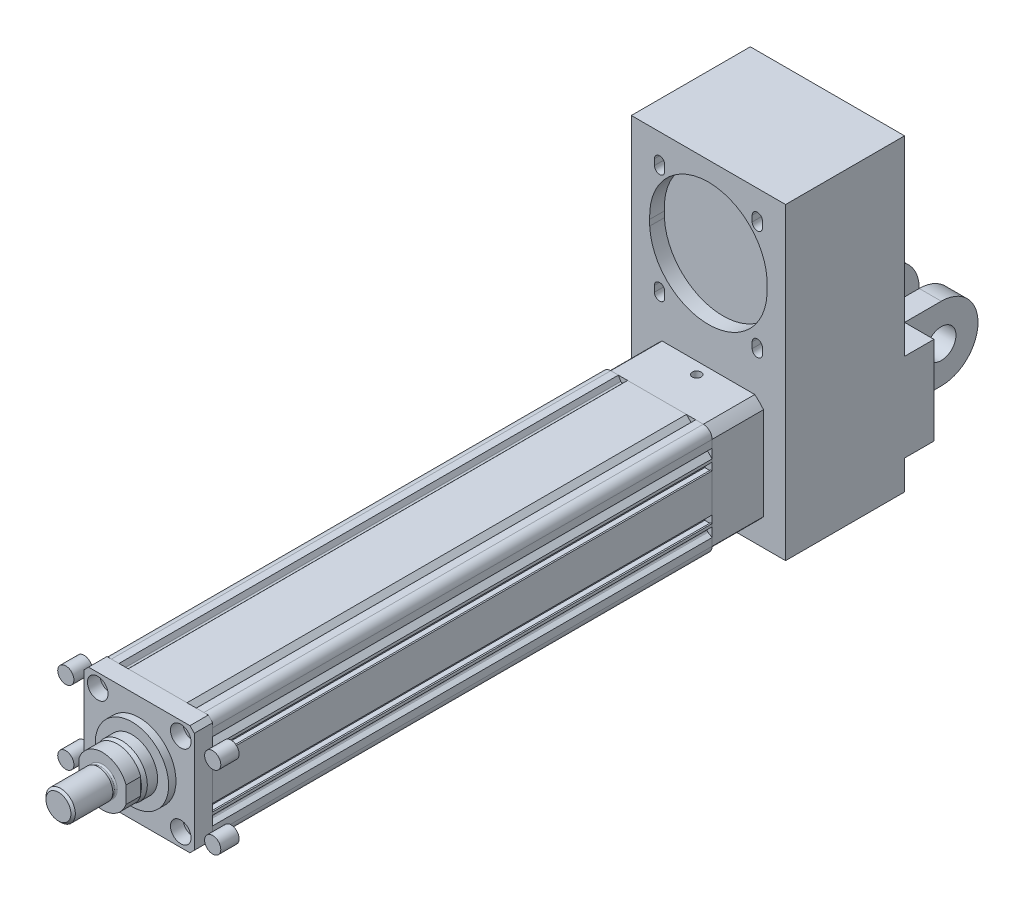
from build123d import *

# Parameters (mm, degrees)
SKETCH_1_R           = 31.5
SKETCH_1_R_2         = 3.35
EXTRUDE_1_DEPTH      = 340
SKETCH_2_R           = 5.5
EXTRUDE_1_2_DEPTH    = 12.5
EXTRUDE_1_2_2_DEPTH  = 12.5
EXTRUDE_1_2_3_DEPTH  = 12.5
EXTRUDE_1_2_4_DEPTH  = 12.5
SKETCH_2_R_2         = 4.25
EXTRUDE_1_2_5_DEPTH  = 12.5
SKETCH_3_R           = 7
SKETCH_3_R_2         = 4.25
CUT_EXTRUDE_1_DEPTH  = 8.5
SKETCH_3_3_R         = 25
EXTRUDE_2_DEPTH      = 5
SKETCH_5_R           = 17.5
EXTRUDE_3_DEPTH      = 10
CHAMFER_1_SIZE       = 3
CHAMFER_1_SIZE2      = 1
EXTRUDE_4_DEPTH      = 10
SKETCH_8_R           = 9
EXTRUDE_5_DEPTH      = 3
SKETCH_9_R           = 10
EXTRUDE_6_DEPTH      = 27
CHAMFER_2_SIZE       = 1.5
FILLET_1_R           = 1
EXTRUDE_7_DEPTH      = 35
SKETCH_11_R          = 3
CUT_EXTRUDE_2_DEPTH  = 5
SKETCH_18_W          = 105
SKETCH_18_H          = 210
EXTRUDE_11_DEPTH     = 81
CUT_EXTRUDE_7_DEPTH  = 10
CUT_EXTRUDE_START    = -10
CUT_EXTRUDE_9_DEPTH  = 5
SKETCH_23_W          = 105
SKETCH_23_H          = 60
EXTRUDE_12_DEPTH     = 20
SKETCH_23_3_W        = 15
SKETCH_23_3_H        = 50
EXTRUDE_13_DEPTH     = 75
SKETCH_24_R          = 10
CUT_EXTRUDE_12_DEPTH = 75
CHAMFER_3_SIZE       = 4


with BuildPart() as part:
    # Sketch 1 → Extrude 1 (new body)
    with BuildSketch(Plane.XY):
        with BuildLine():
            Line((-31.5, 37.5), (-26.33, 37.5))
            Line((-26.33, 37.5), (-24.66467188, 34.615567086))
            ThreePointArc((-24.66467188, 34.615567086), (-23.929172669, 34.124122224), (-23.091539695, 34.408460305))
            Line((-23.091539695, 34.408460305), (-20, 37.5))
            Line((-20, 37.5), (20, 37.5))
            Line((20, 37.5), (23.091539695, 34.408460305))
            ThreePointArc((23.091539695, 34.408460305), (23.929172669, 34.124122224), (24.66467188, 34.615567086))
            Line((24.66467188, 34.615567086), (26.33, 37.5))
            Line((26.33, 37.5), (31.5, 37.5))
            ThreePointArc((31.5, 37.5), (35.742640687, 35.742640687), (37.5, 31.5))
            Line((37.5, 31.5), (37.5, 26.33))
            Line((37.5, 26.33), (34.615567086, 24.66467188))
            ThreePointArc((34.615567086, 24.66467188), (34.124122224, 23.929172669), (34.408460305, 23.091539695))
            Line((34.408460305, 23.091539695), (37.5, 20))
            Line((37.5, 20), (37.5, 18.1))
            Line((37.5, 18.1), (36.5, 18.1))
            Line((36.5, 18.1), (36.5, 18.7))
            Line((36.5, 18.7), (32.5, 18.7))
            Line((32.5, 18.7), (32.5, 12.4))
            Line((32.5, 12.4), (36.5, 12.4))
            Line((36.5, 12.4), (36.5, 13))
            Line((36.5, 13), (37.5, 13))
            Line((37.5, 13), (37.5, -13))
            Line((37.5, -13), (36.5, -13))
            Line((36.5, -13), (36.5, -12.4))
            Line((36.5, -12.4), (32.5, -12.4))
            Line((32.5, -12.4), (32.5, -18.7))
            Line((32.5, -18.7), (36.5, -18.7))
            Line((36.5, -18.7), (36.5, -18.1))
            Line((36.5, -18.1), (37.5, -18.1))
            Line((37.5, -18.1), (37.5, -20))
            Line((37.5, -20), (34.408460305, -23.091539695))
            ThreePointArc((34.408460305, -23.091539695), (34.124122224, -23.929172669), (34.615567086, -24.66467188))
            Line((34.615567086, -24.66467188), (37.5, -26.33))
            Line((37.5, -26.33), (37.5, -31.5))
            ThreePointArc((37.5, -31.5), (35.742640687, -35.742640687), (31.5, -37.5))
            Line((31.5, -37.5), (26.33, -37.5))
            Line((26.33, -37.5), (24.66467188, -34.615567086))
            ThreePointArc((24.66467188, -34.615567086), (23.929172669, -34.124122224), (23.091539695, -34.408460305))
            Line((23.091539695, -34.408460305), (20, -37.5))
            Line((20, -37.5), (18.1, -37.5))
            Line((18.1, -37.5), (18.1, -36.5))
            Line((18.1, -36.5), (18.7, -36.5))
            Line((18.7, -36.5), (18.7, -33.945032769))
            Line((18.7, -33.945032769), (12.4, -33.945032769))
            Line((12.4, -33.945032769), (12.4, -36.5))
            Line((12.4, -36.5), (13, -36.5))
            Line((13, -36.5), (13, -37.5))
            Line((13, -37.5), (-13, -37.5))
            Line((-13, -37.5), (-13, -36.5))
            Line((-13, -36.5), (-12.4, -36.5))
            Line((-12.4, -36.5), (-12.4, -33.945032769))
            Line((-12.4, -33.945032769), (-18.7, -33.945032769))
            Line((-18.7, -33.945032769), (-18.7, -36.5))
            Line((-18.7, -36.5), (-18.1, -36.5))
            Line((-18.1, -36.5), (-18.1, -37.5))
            Line((-18.1, -37.5), (-20, -37.5))
            Line((-20, -37.5), (-23.091539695, -34.408460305))
            ThreePointArc((-23.091539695, -34.408460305), (-23.929172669, -34.124122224), (-24.66467188, -34.615567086))
            Line((-24.66467188, -34.615567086), (-26.33, -37.5))
            Line((-26.33, -37.5), (-31.5, -37.5))
            ThreePointArc((-31.5, -37.5), (-35.742640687, -35.742640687), (-37.5, -31.5))
            Line((-37.5, -31.5), (-37.5, -26.33))
            Line((-37.5, -26.33), (-34.615567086, -24.66467188))
            ThreePointArc((-34.615567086, -24.66467188), (-34.124122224, -23.929172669), (-34.408460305, -23.091539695))
            Line((-34.408460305, -23.091539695), (-37.5, -20))
            Line((-37.5, -20), (-37.5, -18.1))
            Line((-37.5, -18.1), (-36.5, -18.1))
            Line((-36.5, -18.1), (-36.5, -18.7))
            Line((-36.5, -18.7), (-32.5, -18.7))
            Line((-32.5, -18.7), (-32.5, -12.4))
            Line((-32.5, -12.4), (-36.5, -12.4))
            Line((-36.5, -12.4), (-36.5, -13))
            Line((-36.5, -13), (-37.5, -13))
            Line((-37.5, -13), (-37.5, 13))
            Line((-37.5, 13), (-36.5, 13))
            Line((-36.5, 13), (-36.5, 12.4))
            Line((-36.5, 12.4), (-32.5, 12.4))
            Line((-32.5, 12.4), (-32.5, 18.7))
            Line((-32.5, 18.7), (-36.5, 18.7))
            Line((-36.5, 18.7), (-36.5, 18.1))
            Line((-36.5, 18.1), (-37.5, 18.1))
            Line((-37.5, 18.1), (-37.5, 20))
            Line((-37.5, 20), (-34.408460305, 23.091539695))
            ThreePointArc((-34.408460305, 23.091539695), (-34.124122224, 23.929172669), (-34.615567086, 24.66467188))
            Line((-34.615567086, 24.66467188), (-37.5, 26.33))
            Line((-37.5, 26.33), (-37.5, 31.5))
            ThreePointArc((-37.5, 31.5), (-35.742640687, 35.742640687), (-31.5, 37.5))
        make_face()
        Circle(SKETCH_1_R, mode=Mode.SUBTRACT)
        with Locations((-28.25, 28.25)):
            Circle(SKETCH_1_R_2, mode=Mode.SUBTRACT)
        with Locations(Location((28.25, 28.25, 0), (0, 0, 180))):
            Circle(SKETCH_1_R_2, mode=Mode.SUBTRACT)
        with Locations((28.25, -28.25)):
            Circle(SKETCH_1_R_2, mode=Mode.SUBTRACT)
        with Locations(Location((-28.25, -28.25, 0), (0, 0, 180))):
            Circle(SKETCH_1_R_2, mode=Mode.SUBTRACT)
    extrude(amount=EXTRUDE_1_DEPTH)


with BuildPart() as body_2:
    # Sketch 2 → Extrude 1 2 (new body)
    with BuildSketch(Plane.XY.offset(340)):
        with Locations((-50, 25)):
            Circle(SKETCH_2_R)
    extrude(amount=EXTRUDE_1_2_DEPTH)


with BuildPart() as body_3:
    # Sketch 2 → Extrude 1 2 2 (new body)
    with BuildSketch(Plane.XY.offset(340)):
        with Locations(Location((50, 25, 0), (0, 0, 180))):
            Circle(SKETCH_2_R)
    extrude(amount=EXTRUDE_1_2_2_DEPTH)


with BuildPart() as body_4:
    # Sketch 2 → Extrude 1 2 3 (new body)
    with BuildSketch(Plane.XY.offset(340)):
        with Locations(Location((-50, -25, 0), (0, 0, 180))):
            Circle(SKETCH_2_R)
    extrude(amount=EXTRUDE_1_2_3_DEPTH)


with BuildPart() as body_5:
    # Sketch 2 → Extrude 1 2 4 (new body)
    with BuildSketch(Plane.XY.offset(340)):
        with Locations((50, -25)):
            Circle(SKETCH_2_R)
    extrude(amount=EXTRUDE_1_2_4_DEPTH)


with BuildPart() as body_6:
    # Sketch 2 → Extrude 1 2 5 (new body)
    with BuildSketch(Plane.XY.offset(340)):
        Polygon((-37.5, 34.5), (-34.5, 37.5), (34.5, 37.5), (37.5, 34.5), (37.5, -34.5), (34.5, -37.5), (-34.5, -37.5), (-37.5, -34.5), align=None)
        with Locations((-28.25, 28.25)):
            Circle(SKETCH_2_R_2, mode=Mode.SUBTRACT)
        with Locations(Location((28.25, 28.25, 0), (0, 0, 180))):
            Circle(SKETCH_2_R_2, mode=Mode.SUBTRACT)
        with Locations(Location((-28.25, -28.25, 0), (0, 0, 180))):
            Circle(SKETCH_2_R_2, mode=Mode.SUBTRACT)
        with Locations((28.25, -28.25)):
            Circle(SKETCH_2_R_2, mode=Mode.SUBTRACT)
    extrude(amount=EXTRUDE_1_2_5_DEPTH)

    # Sketch 3 → Cut-Extrude 1 (cut)
    # profile 1 of 4: a face of its own
    with BuildSketch(Plane.XY.offset(352.5)):
        with Locations((28.25, -28.25)):
            Circle(SKETCH_3_R)
        with Locations((28.25, -28.25)):
            Circle(SKETCH_3_R_2, mode=Mode.SUBTRACT)
    # profile 2 of 4: a face of its own
    with BuildSketch(Plane.XY.offset(352.5)):
        with Locations((-28.25, -28.25)):
            Circle(SKETCH_3_R)
        with Locations(Location((-28.25, -28.25, 0), (0, 0, 180))):
            Circle(SKETCH_3_R_2, mode=Mode.SUBTRACT)
    # profile 3 of 4: a face of its own
    with BuildSketch(Plane.XY.offset(352.5)):
        with Locations((-28.25, 28.25)):
            Circle(SKETCH_3_R)
    # profile 4 of 4: a face of its own
    with BuildSketch(Plane.XY.offset(352.5)):
        with Locations((28.25, 28.25)):
            Circle(SKETCH_3_R)
    extrude(amount=-CUT_EXTRUDE_1_DEPTH, mode=Mode.SUBTRACT)

    # Sketch 3_3 → Extrude 2 (add)
    with BuildSketch(Plane.XY.offset(352.5)):
        Circle(SKETCH_3_3_R)
    extrude(amount=EXTRUDE_2_DEPTH)

    # Sketch 5 → Extrude 3 (add)
    with BuildSketch(Plane.XY.offset(357.5)):
        Circle(SKETCH_5_R)
    extrude(amount=EXTRUDE_3_DEPTH)

    # Chamfer 1
    chamfer_1_edges = [body_6.edges().sort_by_distance(p)[0] for p in [
        (-17.5, 0, 367.5),
    ]]
    chamfer_1_side = [body_6.faces().sort_by_distance(p)[0] for p in [
        (-17.5, 0, 362.5),
    ]]
    chamfer(chamfer_1_edges, length=CHAMFER_1_SIZE, length2=CHAMFER_1_SIZE2, reference=chamfer_1_side[0])

    # Sketch 6 → Extrude 4 (add)
    with BuildSketch(Plane.XY.offset(367.5)):
        with BuildLine():
            Line((-16, 5.744562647), (-16, -5.744562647))
            ThreePointArc((-16, -5.744562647), (0, -17), (16, -5.744562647))
            Line((16, -5.744562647), (16, 5.744562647))
            ThreePointArc((16, 5.744562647), (0, 17), (-16, 5.744562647))
        make_face()
    extrude(amount=EXTRUDE_4_DEPTH)

    # Sketch 8 → Extrude 5 (add)
    with BuildSketch(Plane.XY.offset(377.5)):
        Circle(SKETCH_8_R)
    extrude(amount=EXTRUDE_5_DEPTH)

    # Sketch 9 → Extrude 6 (add)
    with BuildSketch(Plane.XY.offset(380.5)):
        Circle(SKETCH_9_R)
    extrude(amount=EXTRUDE_6_DEPTH)

    # Chamfer 2
    chamfer_2_edges = [body_6.edges().sort_by_distance(p)[0] for p in [
        (-10, 0, 407.5),
    ]]
    chamfer(chamfer_2_edges, length=CHAMFER_2_SIZE)

    # Fillet 1
    fillet_1_edges = [body_6.edges().sort_by_distance(p)[0] for p in [
        (-9, 0, 377.5),
    ]]
    fillet(fillet_1_edges, radius=FILLET_1_R)


with BuildPart() as body_7:
    # Sketch 10 → Extrude 7 (new body)
    with BuildSketch(Plane(origin=(0, 0, 0), x_dir=(-1, 0, 0), z_dir=(0, 0, -1))):
        with BuildLine():
            Line((-31.539657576, 37.5), (31.539657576, 37.5))
            ThreePointArc((31.539657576, 37.5), (34.648232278, 34.648232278), (37.5, 31.539657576))
            Line((37.5, 31.539657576), (37.5, -31.539657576))
            ThreePointArc((37.5, -31.539657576), (34.648232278, -34.648232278), (31.539657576, -37.5))
            Line((31.539657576, -37.5), (-31.539657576, -37.5))
            ThreePointArc((-31.539657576, -37.5), (-34.648232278, -34.648232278), (-37.5, -31.539657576))
            Line((-37.5, -31.539657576), (-37.5, 31.539657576))
            ThreePointArc((-37.5, 31.539657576), (-34.648232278, 34.648232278), (-31.539657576, 37.5))
        make_face()
    extrude(amount=EXTRUDE_7_DEPTH)

    # Sketch 11 → Cut-Extrude 2 (cut)
    with BuildSketch(Plane(origin=(0, 37.5, 0), x_dir=(1, 0, 0), z_dir=(0, 1, 0))):
        with Locations(Location((0, 27, 0), (0, 0, 270))):
            Circle(SKETCH_11_R)
    extrude(amount=-CUT_EXTRUDE_2_DEPTH, mode=Mode.SUBTRACT)

    # Sketch 18 → Extrude 11 (add)
    with BuildSketch(Plane(origin=(0, 0, -35), x_dir=(-1, 0, 0), z_dir=(0, 0, -1))):
        with Locations((0, 55)):
            Rectangle(SKETCH_18_W, SKETCH_18_H)
    extrude(amount=EXTRUDE_11_DEPTH)

    # Sketch 19 → Cut-Extrude 7 (cut)
    with BuildSketch(Plane.XY.offset(-35)):
        with BuildLine():
            Line((-40, 105), (-40, 101))
            ThreePointArc((-40, 101), (-0.049906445, 62.997504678), (39.90018711, 101))
            Line((39.90018711, 101), (39.90018711, 105))
            ThreePointArc((39.90018711, 105), (-0.049906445, 146.997504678), (-40, 105))
        make_face()
        with BuildLine():
            Line((-36.761032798, 138.332341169), (-36.761032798, 142.332341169))
            ThreePointArc((-36.761032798, 142.332341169), (-33.261032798, 145.832341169), (-29.761032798, 142.332341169))
            Line((-29.761032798, 142.332341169), (-29.761032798, 138.332341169))
            ThreePointArc((-29.761032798, 138.332341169), (-33.261032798, 134.832341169), (-36.761032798, 138.332341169))
        make_face()
        with BuildLine():
            Line((36.761032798, 138.332341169), (36.761032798, 142.332341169))
            ThreePointArc((36.761032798, 142.332341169), (33.261032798, 145.832341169), (29.761032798, 142.332341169))
            Line((29.761032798, 142.332341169), (29.761032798, 138.332341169))
            ThreePointArc((29.761032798, 138.332341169), (33.261032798, 134.832341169), (36.761032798, 138.332341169))
        make_face()
        with BuildLine():
            Line((36.761032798, 67.667658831), (36.761032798, 63.667658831))
            ThreePointArc((36.761032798, 63.667658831), (33.261032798, 60.167658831), (29.761032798, 63.667658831))
            Line((29.761032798, 63.667658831), (29.761032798, 67.667658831))
            ThreePointArc((29.761032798, 67.667658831), (33.261032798, 71.167658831), (36.761032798, 67.667658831))
        make_face()
        with BuildLine():
            Line((-36.761032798, 67.667658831), (-36.761032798, 63.667658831))
            ThreePointArc((-36.761032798, 63.667658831), (-33.261032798, 60.167658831), (-29.761032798, 63.667658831))
            Line((-29.761032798, 63.667658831), (-29.761032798, 67.667658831))
            ThreePointArc((-29.761032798, 67.667658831), (-33.261032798, 71.167658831), (-36.761032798, 67.667658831))
        make_face()
    extrude(amount=-CUT_EXTRUDE_7_DEPTH, mode=Mode.SUBTRACT)

    # Sketch 19_3 → Cut-Extrude 9 (cut)
    with BuildSketch(Plane.XY.offset(-35).offset(CUT_EXTRUDE_START)):
        with BuildLine():
            Line((-38.461032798, 138.282341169), (-38.461032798, 142.382341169))
            ThreePointArc((-38.461032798, 142.382341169), (-33.261032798, 147.582341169), (-28.061032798, 142.382341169))
            Line((-28.061032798, 142.382341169), (-28.061032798, 138.282341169))
            ThreePointArc((-28.061032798, 138.282341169), (-33.261032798, 133.082341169), (-38.461032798, 138.282341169))
        make_face()
        with BuildLine():
            Line((38.461032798, 138.282341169), (38.461032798, 142.382341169))
            ThreePointArc((38.461032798, 142.382341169), (33.261032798, 147.582341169), (28.061032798, 142.382341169))
            Line((28.061032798, 142.382341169), (28.061032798, 138.282341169))
            ThreePointArc((28.061032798, 138.282341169), (33.261032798, 133.082341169), (38.461032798, 138.282341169))
        make_face()
        with BuildLine():
            Line((38.461032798, 67.717658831), (38.461032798, 63.617658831))
            ThreePointArc((38.461032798, 63.617658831), (33.261032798, 58.417658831), (28.061032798, 63.617658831))
            Line((28.061032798, 63.617658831), (28.061032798, 67.717658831))
            ThreePointArc((28.061032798, 67.717658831), (33.261032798, 72.917658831), (38.461032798, 67.717658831))
        make_face()
        with BuildLine():
            Line((-38.461032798, 67.717658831), (-38.461032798, 63.617658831))
            ThreePointArc((-38.461032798, 63.617658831), (-33.261032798, 58.417658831), (-28.061032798, 63.617658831))
            Line((-28.061032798, 63.617658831), (-28.061032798, 67.717658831))
            ThreePointArc((-28.061032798, 67.717658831), (-33.261032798, 72.917658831), (-38.461032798, 67.717658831))
        make_face()
    extrude(amount=-CUT_EXTRUDE_9_DEPTH, mode=Mode.SUBTRACT)



with BuildPart() as body_8:
    # Sketch 23 → Extrude 12 (new body)
    with BuildSketch(Plane(origin=(0, 0, -116), x_dir=(-1, 0, 0), z_dir=(0, 0, -1))):
        Rectangle(SKETCH_23_W, SKETCH_23_H)
    extrude(amount=EXTRUDE_12_DEPTH)


with BuildPart() as body_7_1:
    add(body_7.part)

    add(body_8.part)  # Extrude 13 merges body 8
    # Sketch 23_3 → Extrude 13 (add)
    with BuildSketch(Plane(origin=(0, 0, -116), x_dir=(-1, 0, 0), z_dir=(0, 0, -1))):
        with Locations((-20, 0)):
            Rectangle(SKETCH_23_3_W, SKETCH_23_3_H)
        with Locations((20, 0)):
            Rectangle(SKETCH_23_3_W, SKETCH_23_3_H)
    extrude(amount=EXTRUDE_13_DEPTH)

    # Sketch 24 → Cut-Extrude 12 (cut)
    with BuildSketch(Plane.ZY.offset(27.5)):
        with Locations(Location((-166, 0, 0), (0, 0, 270))):
            Circle(SKETCH_24_R)
        with BuildLine():
            Line((-166, 25), (-243.888885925, 56.188594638))
            Line((-243.888885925, 56.188594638), (-293.981972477, -19.173584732))
            Line((-293.981972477, -19.173584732), (-270.266018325, -89.913037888))
            Line((-270.266018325, -89.913037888), (-166, -25))
            ThreePointArc((-166, -25), (-191, 0), (-166, 25))
        make_face()
    extrude(amount=-CUT_EXTRUDE_12_DEPTH, mode=Mode.SUBTRACT)

    # Chamfer 3
    chamfer_3_edges = [body_7_1.edges().sort_by_distance(p)[0] for p in [
        (20, 25, -136),
        (12.5, 0, -136),
        (27.5, 0, -136),
        (20, -25, -136),
        (-20, 25, -136),
        (-27.5, 0, -136),
        (-20, -25, -136),
        (-12.5, 0, -136),
    ]]
    chamfer(chamfer_3_edges, length=CHAMFER_3_SIZE)


solid = Compound([part.part, body_2.part, body_3.part, body_4.part, body_5.part, body_6.part, body_7_1.part])
